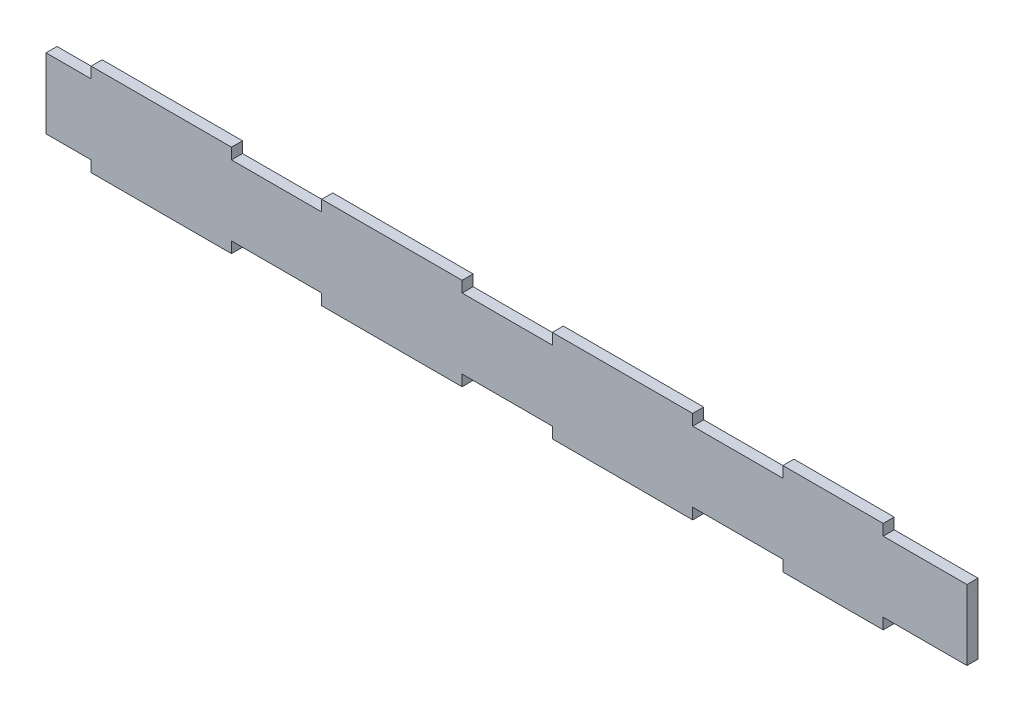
ISO-10303-21;
HEADER;
FILE_DESCRIPTION(('STEP AP214'),'2;1');
FILE_NAME('part.step','',(''),(''),'','','');
FILE_SCHEMA(('AUTOMOTIVE_DESIGN { 1 0 10303 214 1 1 1 1 }'));
ENDSEC;
DATA;
#1=APPLICATION_CONTEXT('core data for automotive mechanical design processes');
#2=APPLICATION_PROTOCOL_DEFINITION('international standard','automotive_design',2000,#1);
#3=PRODUCT_CONTEXT('',#1,'mechanical');
#4=PRODUCT('Part','Part','',(#3));
#5=PRODUCT_RELATED_PRODUCT_CATEGORY('part','',(#4));
#6=PRODUCT_DEFINITION_FORMATION('','',#4);
#7=PRODUCT_DEFINITION_CONTEXT('part definition',#1,'design');
#8=PRODUCT_DEFINITION('design','',#6,#7);
#9=PRODUCT_DEFINITION_SHAPE('','',#8);
#10=(LENGTH_UNIT() NAMED_UNIT(*) SI_UNIT(.MILLI.,.METRE.));
#11=(NAMED_UNIT(*) PLANE_ANGLE_UNIT() SI_UNIT($,.RADIAN.));
#12=(NAMED_UNIT(*) SI_UNIT($,.STERADIAN.) SOLID_ANGLE_UNIT());
#13=UNCERTAINTY_MEASURE_WITH_UNIT(LENGTH_MEASURE(1.E-05),#10,'distance_accuracy_value','');
#14=(GEOMETRIC_REPRESENTATION_CONTEXT(3) GLOBAL_UNCERTAINTY_ASSIGNED_CONTEXT((#13)) GLOBAL_UNIT_ASSIGNED_CONTEXT((#10,
#11,#12)) REPRESENTATION_CONTEXT('',''));
#15=CARTESIAN_POINT('',(0.,0.,0.));
#16=DIRECTION('',(0.,0.,1.));
#17=DIRECTION('',(1.,0.,0.));
#18=AXIS2_PLACEMENT_3D('',#15,#16,#17);
#19=CARTESIAN_POINT('',(228.449972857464,55.4483942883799,5.5));
#20=DIRECTION('',(0.,1.,0.));
#21=DIRECTION('',(0.,0.,1.));
#22=AXIS2_PLACEMENT_3D('',#19,#20,#21);
#23=PLANE('',#22);
#24=DIRECTION('',(1.,0.,0.));
#25=VECTOR('',#24,1.);
#26=CARTESIAN_POINT('',(228.449972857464,55.4483942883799,0.));
#27=LINE('',#26,#25);
#28=CARTESIAN_POINT('',(186.668210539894,55.4483942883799,0.));
#29=VERTEX_POINT('',#28);
#30=CARTESIAN_POINT('',(228.449972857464,55.4483942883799,0.));
#31=VERTEX_POINT('',#30);
#32=EDGE_CURVE('E177',#29,#31,#27,.T.);
#33=ORIENTED_EDGE('',*,*,#32,.T.);
#34=DIRECTION('',(0.,0.,-1.));
#35=VECTOR('',#34,1.);
#36=CARTESIAN_POINT('',(228.449972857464,55.4483942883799,5.5));
#37=LINE('',#36,#35);
#38=CARTESIAN_POINT('',(228.449972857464,55.4483942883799,5.5));
#39=VERTEX_POINT('',#38);
#40=EDGE_CURVE('E11',#39,#31,#37,.T.);
#41=ORIENTED_EDGE('',*,*,#40,.F.);
#42=DIRECTION('',(1.,0.,0.));
#43=VECTOR('',#42,1.);
#44=CARTESIAN_POINT('',(186.668210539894,55.4483942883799,5.5));
#45=LINE('',#44,#43);
#46=CARTESIAN_POINT('',(186.668210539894,55.4483942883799,5.5));
#47=VERTEX_POINT('',#46);
#48=EDGE_CURVE('E183',#47,#39,#45,.T.);
#49=ORIENTED_EDGE('',*,*,#48,.F.);
#50=DIRECTION('',(0.,0.,-1.));
#51=VECTOR('',#50,1.);
#52=CARTESIAN_POINT('',(186.668210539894,55.4483942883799,5.5));
#53=LINE('',#52,#51);
#54=EDGE_CURVE('E301',#47,#29,#53,.T.);
#55=ORIENTED_EDGE('',*,*,#54,.T.);
#56=EDGE_LOOP('',(#33,#41,#49,#55));
#57=FACE_BOUND('',#56,.T.);
#58=ADVANCED_FACE('F41',(#57),#23,.F.);
#59=CARTESIAN_POINT('',(228.449972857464,90.4483942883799,5.5));
#60=DIRECTION('',(-1.,0.,0.));
#61=DIRECTION('',(0.,0.,1.));
#62=AXIS2_PLACEMENT_3D('',#59,#60,#61);
#63=PLANE('',#62);
#64=DIRECTION('',(0.,1.,0.));
#65=VECTOR('',#64,1.);
#66=CARTESIAN_POINT('',(228.449972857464,90.4483942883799,0.));
#67=LINE('',#66,#65);
#68=CARTESIAN_POINT('',(228.449972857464,90.4483942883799,0.));
#69=VERTEX_POINT('',#68);
#70=EDGE_CURVE('E306',#31,#69,#67,.T.);
#71=ORIENTED_EDGE('',*,*,#70,.T.);
#72=DIRECTION('',(0.,0.,-1.));
#73=VECTOR('',#72,1.);
#74=CARTESIAN_POINT('',(228.449972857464,90.4483942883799,5.5));
#75=LINE('',#74,#73);
#76=CARTESIAN_POINT('',(228.449972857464,90.4483942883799,5.5));
#77=VERTEX_POINT('',#76);
#78=EDGE_CURVE('E49',#77,#69,#75,.T.);
#79=ORIENTED_EDGE('',*,*,#78,.F.);
#80=DIRECTION('',(0.,1.,0.));
#81=VECTOR('',#80,1.);
#82=CARTESIAN_POINT('',(228.449972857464,90.4483942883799,5.5));
#83=LINE('',#82,#81);
#84=EDGE_CURVE('E478',#39,#77,#83,.T.);
#85=ORIENTED_EDGE('',*,*,#84,.F.);
#86=ORIENTED_EDGE('',*,*,#40,.T.);
#87=EDGE_LOOP('',(#71,#79,#85,#86));
#88=FACE_BOUND('',#87,.T.);
#89=ADVANCED_FACE('F477',(#88),#63,.F.);
#90=CARTESIAN_POINT('',(186.668210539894,90.4483942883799,5.5));
#91=DIRECTION('',(0.,-1.,0.));
#92=DIRECTION('',(0.,0.,-1.));
#93=AXIS2_PLACEMENT_3D('',#90,#91,#92);
#94=PLANE('',#93);
#95=DIRECTION('',(-1.,0.,0.));
#96=VECTOR('',#95,1.);
#97=CARTESIAN_POINT('',(186.668210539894,90.4483942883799,0.));
#98=LINE('',#97,#96);
#99=CARTESIAN_POINT('',(186.668210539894,90.4483942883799,0.));
#100=VERTEX_POINT('',#99);
#101=EDGE_CURVE('E309',#69,#100,#98,.T.);
#102=ORIENTED_EDGE('',*,*,#101,.T.);
#103=DIRECTION('',(0.,0.,-1.));
#104=VECTOR('',#103,1.);
#105=CARTESIAN_POINT('',(186.668210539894,90.4483942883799,5.5));
#106=LINE('',#105,#104);
#107=CARTESIAN_POINT('',(186.668210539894,90.4483942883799,5.5));
#108=VERTEX_POINT('',#107);
#109=EDGE_CURVE('E466',#108,#100,#106,.T.);
#110=ORIENTED_EDGE('',*,*,#109,.F.);
#111=DIRECTION('',(-1.,0.,0.));
#112=VECTOR('',#111,1.);
#113=CARTESIAN_POINT('',(206.668210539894,90.4483942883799,5.5));
#114=LINE('',#113,#112);
#115=EDGE_CURVE('E474',#77,#108,#114,.T.);
#116=ORIENTED_EDGE('',*,*,#115,.F.);
#117=ORIENTED_EDGE('',*,*,#78,.T.);
#118=EDGE_LOOP('',(#102,#110,#116,#117));
#119=FACE_BOUND('',#118,.T.);
#120=ADVANCED_FACE('F472',(#119),#94,.F.);
#121=CARTESIAN_POINT('',(186.668210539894,95.9483942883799,5.5));
#122=DIRECTION('',(-1.,0.,0.));
#123=DIRECTION('',(0.,0.,1.));
#124=AXIS2_PLACEMENT_3D('',#121,#122,#123);
#125=PLANE('',#124);
#126=DIRECTION('',(0.,1.,0.));
#127=VECTOR('',#126,1.);
#128=CARTESIAN_POINT('',(186.668210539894,95.9483942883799,0.));
#129=LINE('',#128,#127);
#130=CARTESIAN_POINT('',(186.668210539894,95.9483942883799,0.));
#131=VERTEX_POINT('',#130);
#132=EDGE_CURVE('E311',#100,#131,#129,.T.);
#133=ORIENTED_EDGE('',*,*,#132,.T.);
#134=DIRECTION('',(0.,0.,-1.));
#135=VECTOR('',#134,1.);
#136=CARTESIAN_POINT('',(186.668210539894,95.9483942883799,5.5));
#137=LINE('',#136,#135);
#138=CARTESIAN_POINT('',(186.668210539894,95.9483942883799,5.5));
#139=VERTEX_POINT('',#138);
#140=EDGE_CURVE('E463',#139,#131,#137,.T.);
#141=ORIENTED_EDGE('',*,*,#140,.F.);
#142=DIRECTION('',(0.,1.,0.));
#143=VECTOR('',#142,1.);
#144=CARTESIAN_POINT('',(186.668210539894,95.9483942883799,5.5));
#145=LINE('',#144,#143);
#146=EDGE_CURVE('E494',#108,#139,#145,.T.);
#147=ORIENTED_EDGE('',*,*,#146,.F.);
#148=ORIENTED_EDGE('',*,*,#109,.T.);
#149=EDGE_LOOP('',(#133,#141,#147,#148));
#150=FACE_BOUND('',#149,.T.);
#151=ADVANCED_FACE('F485',(#150),#125,.F.);
#152=CARTESIAN_POINT('',(136.668210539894,95.9483942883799,5.5));
#153=DIRECTION('',(0.,-1.,0.));
#154=DIRECTION('',(0.,0.,-1.));
#155=AXIS2_PLACEMENT_3D('',#152,#153,#154);
#156=PLANE('',#155);
#157=DIRECTION('',(-1.,0.,0.));
#158=VECTOR('',#157,1.);
#159=CARTESIAN_POINT('',(136.668210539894,95.9483942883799,0.));
#160=LINE('',#159,#158);
#161=CARTESIAN_POINT('',(136.668210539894,95.9483942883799,0.));
#162=VERTEX_POINT('',#161);
#163=EDGE_CURVE('E313',#131,#162,#160,.T.);
#164=ORIENTED_EDGE('',*,*,#163,.T.);
#165=DIRECTION('',(0.,0.,-1.));
#166=VECTOR('',#165,1.);
#167=CARTESIAN_POINT('',(136.668210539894,95.9483942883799,5.5));
#168=LINE('',#167,#166);
#169=CARTESIAN_POINT('',(136.668210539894,95.9483942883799,5.5));
#170=VERTEX_POINT('',#169);
#171=EDGE_CURVE('E460',#170,#162,#168,.T.);
#172=ORIENTED_EDGE('',*,*,#171,.F.);
#173=DIRECTION('',(-1.,0.,0.));
#174=VECTOR('',#173,1.);
#175=CARTESIAN_POINT('',(136.668210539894,95.9483942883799,5.5));
#176=LINE('',#175,#174);
#177=EDGE_CURVE('E491',#139,#170,#176,.T.);
#178=ORIENTED_EDGE('',*,*,#177,.F.);
#179=ORIENTED_EDGE('',*,*,#140,.T.);
#180=EDGE_LOOP('',(#164,#172,#178,#179));
#181=FACE_BOUND('',#180,.T.);
#182=ADVANCED_FACE('F489',(#181),#156,.F.);
#183=CARTESIAN_POINT('',(136.668210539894,90.4483942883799,5.5));
#184=DIRECTION('',(1.,0.,0.));
#185=DIRECTION('',(0.,0.,-1.));
#186=AXIS2_PLACEMENT_3D('',#183,#184,#185);
#187=PLANE('',#186);
#188=DIRECTION('',(0.,-1.,0.));
#189=VECTOR('',#188,1.);
#190=CARTESIAN_POINT('',(136.668210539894,90.4483942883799,0.));
#191=LINE('',#190,#189);
#192=CARTESIAN_POINT('',(136.668210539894,90.4483942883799,0.));
#193=VERTEX_POINT('',#192);
#194=EDGE_CURVE('E315',#162,#193,#191,.T.);
#195=ORIENTED_EDGE('',*,*,#194,.T.);
#196=DIRECTION('',(0.,0.,-1.));
#197=VECTOR('',#196,1.);
#198=CARTESIAN_POINT('',(136.668210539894,90.4483942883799,5.5));
#199=LINE('',#198,#197);
#200=CARTESIAN_POINT('',(136.668210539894,90.4483942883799,5.5));
#201=VERTEX_POINT('',#200);
#202=EDGE_CURVE('E457',#201,#193,#199,.T.);
#203=ORIENTED_EDGE('',*,*,#202,.F.);
#204=DIRECTION('',(0.,-1.,0.));
#205=VECTOR('',#204,1.);
#206=CARTESIAN_POINT('',(136.668210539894,90.4483942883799,5.5));
#207=LINE('',#206,#205);
#208=EDGE_CURVE('E493',#170,#201,#207,.T.);
#209=ORIENTED_EDGE('',*,*,#208,.F.);
#210=ORIENTED_EDGE('',*,*,#171,.T.);
#211=EDGE_LOOP('',(#195,#203,#209,#210));
#212=FACE_BOUND('',#211,.T.);
#213=ADVANCED_FACE('F579',(#212),#187,.F.);
#214=CARTESIAN_POINT('',(91.6682105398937,90.4483942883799,5.5));
#215=DIRECTION('',(0.,-1.,0.));
#216=DIRECTION('',(0.,0.,-1.));
#217=AXIS2_PLACEMENT_3D('',#214,#215,#216);
#218=PLANE('',#217);
#219=DIRECTION('',(-1.,0.,0.));
#220=VECTOR('',#219,1.);
#221=CARTESIAN_POINT('',(91.6682105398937,90.4483942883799,0.));
#222=LINE('',#221,#220);
#223=CARTESIAN_POINT('',(91.6682105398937,90.4483942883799,0.));
#224=VERTEX_POINT('',#223);
#225=EDGE_CURVE('E317',#193,#224,#222,.T.);
#226=ORIENTED_EDGE('',*,*,#225,.T.);
#227=DIRECTION('',(0.,0.,-1.));
#228=VECTOR('',#227,1.);
#229=CARTESIAN_POINT('',(91.6682105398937,90.4483942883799,5.5));
#230=LINE('',#229,#228);
#231=CARTESIAN_POINT('',(91.6682105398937,90.4483942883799,5.5));
#232=VERTEX_POINT('',#231);
#233=EDGE_CURVE('E454',#232,#224,#230,.T.);
#234=ORIENTED_EDGE('',*,*,#233,.F.);
#235=DIRECTION('',(-1.,0.,0.));
#236=VECTOR('',#235,1.);
#237=CARTESIAN_POINT('',(91.6682105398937,90.4483942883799,5.5));
#238=LINE('',#237,#236);
#239=EDGE_CURVE('E496',#201,#232,#238,.T.);
#240=ORIENTED_EDGE('',*,*,#239,.F.);
#241=ORIENTED_EDGE('',*,*,#202,.T.);
#242=EDGE_LOOP('',(#226,#234,#240,#241));
#243=FACE_BOUND('',#242,.T.);
#244=ADVANCED_FACE('F582',(#243),#218,.F.);
#245=CARTESIAN_POINT('',(91.6682105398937,95.9483942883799,5.5));
#246=DIRECTION('',(-1.,0.,0.));
#247=DIRECTION('',(0.,0.,1.));
#248=AXIS2_PLACEMENT_3D('',#245,#246,#247);
#249=PLANE('',#248);
#250=DIRECTION('',(0.,1.,0.));
#251=VECTOR('',#250,1.);
#252=CARTESIAN_POINT('',(91.6682105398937,95.9483942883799,0.));
#253=LINE('',#252,#251);
#254=CARTESIAN_POINT('',(91.6682105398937,95.9483942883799,0.));
#255=VERTEX_POINT('',#254);
#256=EDGE_CURVE('E319',#224,#255,#253,.T.);
#257=ORIENTED_EDGE('',*,*,#256,.T.);
#258=DIRECTION('',(0.,0.,-1.));
#259=VECTOR('',#258,1.);
#260=CARTESIAN_POINT('',(91.6682105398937,95.9483942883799,5.5));
#261=LINE('',#260,#259);
#262=CARTESIAN_POINT('',(91.6682105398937,95.9483942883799,5.5));
#263=VERTEX_POINT('',#262);
#264=EDGE_CURVE('E451',#263,#255,#261,.T.);
#265=ORIENTED_EDGE('',*,*,#264,.F.);
#266=DIRECTION('',(0.,1.,0.));
#267=VECTOR('',#266,1.);
#268=CARTESIAN_POINT('',(91.6682105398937,95.9483942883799,5.5));
#269=LINE('',#268,#267);
#270=EDGE_CURVE('E502',#232,#263,#269,.T.);
#271=ORIENTED_EDGE('',*,*,#270,.F.);
#272=ORIENTED_EDGE('',*,*,#233,.T.);
#273=EDGE_LOOP('',(#257,#265,#271,#272));
#274=FACE_BOUND('',#273,.T.);
#275=ADVANCED_FACE('F586',(#274),#249,.F.);
#276=CARTESIAN_POINT('',(21.6682105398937,95.9483942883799,5.5));
#277=DIRECTION('',(0.,-1.,0.));
#278=DIRECTION('',(0.,0.,-1.));
#279=AXIS2_PLACEMENT_3D('',#276,#277,#278);
#280=PLANE('',#279);
#281=DIRECTION('',(-1.,0.,0.));
#282=VECTOR('',#281,1.);
#283=CARTESIAN_POINT('',(21.6682105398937,95.9483942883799,0.));
#284=LINE('',#283,#282);
#285=CARTESIAN_POINT('',(21.6682105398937,95.9483942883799,0.));
#286=VERTEX_POINT('',#285);
#287=EDGE_CURVE('E321',#255,#286,#284,.T.);
#288=ORIENTED_EDGE('',*,*,#287,.T.);
#289=DIRECTION('',(0.,0.,-1.));
#290=VECTOR('',#289,1.);
#291=CARTESIAN_POINT('',(21.6682105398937,95.9483942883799,5.5));
#292=LINE('',#291,#290);
#293=CARTESIAN_POINT('',(21.6682105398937,95.9483942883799,5.5));
#294=VERTEX_POINT('',#293);
#295=EDGE_CURVE('E448',#294,#286,#292,.T.);
#296=ORIENTED_EDGE('',*,*,#295,.F.);
#297=DIRECTION('',(-1.,0.,0.));
#298=VECTOR('',#297,1.);
#299=CARTESIAN_POINT('',(21.6682105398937,95.9483942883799,5.5));
#300=LINE('',#299,#298);
#301=EDGE_CURVE('E504',#263,#294,#300,.T.);
#302=ORIENTED_EDGE('',*,*,#301,.F.);
#303=ORIENTED_EDGE('',*,*,#264,.T.);
#304=EDGE_LOOP('',(#288,#296,#302,#303));
#305=FACE_BOUND('',#304,.T.);
#306=ADVANCED_FACE('F590',(#305),#280,.F.);
#307=CARTESIAN_POINT('',(21.6682105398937,90.4483942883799,5.5));
#308=DIRECTION('',(1.,0.,0.));
#309=DIRECTION('',(0.,0.,-1.));
#310=AXIS2_PLACEMENT_3D('',#307,#308,#309);
#311=PLANE('',#310);
#312=DIRECTION('',(0.,-1.,0.));
#313=VECTOR('',#312,1.);
#314=CARTESIAN_POINT('',(21.6682105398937,90.4483942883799,0.));
#315=LINE('',#314,#313);
#316=CARTESIAN_POINT('',(21.6682105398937,90.4483942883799,0.));
#317=VERTEX_POINT('',#316);
#318=EDGE_CURVE('E323',#286,#317,#315,.T.);
#319=ORIENTED_EDGE('',*,*,#318,.T.);
#320=DIRECTION('',(0.,0.,-1.));
#321=VECTOR('',#320,1.);
#322=CARTESIAN_POINT('',(21.6682105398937,90.4483942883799,5.5));
#323=LINE('',#322,#321);
#324=CARTESIAN_POINT('',(21.6682105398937,90.4483942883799,5.5));
#325=VERTEX_POINT('',#324);
#326=EDGE_CURVE('E445',#325,#317,#323,.T.);
#327=ORIENTED_EDGE('',*,*,#326,.F.);
#328=DIRECTION('',(0.,-1.,0.));
#329=VECTOR('',#328,1.);
#330=CARTESIAN_POINT('',(21.6682105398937,90.4483942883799,5.5));
#331=LINE('',#330,#329);
#332=EDGE_CURVE('E506',#294,#325,#331,.T.);
#333=ORIENTED_EDGE('',*,*,#332,.F.);
#334=ORIENTED_EDGE('',*,*,#295,.T.);
#335=EDGE_LOOP('',(#319,#327,#333,#334));
#336=FACE_BOUND('',#335,.T.);
#337=ADVANCED_FACE('F594',(#336),#311,.F.);
#338=CARTESIAN_POINT('',(-23.3317894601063,90.4483942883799,5.5));
#339=DIRECTION('',(0.,-1.,0.));
#340=DIRECTION('',(0.,0.,-1.));
#341=AXIS2_PLACEMENT_3D('',#338,#339,#340);
#342=PLANE('',#341);
#343=DIRECTION('',(-1.,0.,0.));
#344=VECTOR('',#343,1.);
#345=CARTESIAN_POINT('',(-23.3317894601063,90.4483942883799,0.));
#346=LINE('',#345,#344);
#347=CARTESIAN_POINT('',(-23.3317894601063,90.4483942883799,0.));
#348=VERTEX_POINT('',#347);
#349=EDGE_CURVE('E325',#317,#348,#346,.T.);
#350=ORIENTED_EDGE('',*,*,#349,.T.);
#351=DIRECTION('',(0.,0.,-1.));
#352=VECTOR('',#351,1.);
#353=CARTESIAN_POINT('',(-23.3317894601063,90.4483942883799,5.5));
#354=LINE('',#353,#352);
#355=CARTESIAN_POINT('',(-23.3317894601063,90.4483942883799,5.5));
#356=VERTEX_POINT('',#355);
#357=EDGE_CURVE('E442',#356,#348,#354,.T.);
#358=ORIENTED_EDGE('',*,*,#357,.F.);
#359=DIRECTION('',(-1.,0.,0.));
#360=VECTOR('',#359,1.);
#361=CARTESIAN_POINT('',(-23.3317894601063,90.4483942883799,5.5));
#362=LINE('',#361,#360);
#363=EDGE_CURVE('E508',#325,#356,#362,.T.);
#364=ORIENTED_EDGE('',*,*,#363,.F.);
#365=ORIENTED_EDGE('',*,*,#326,.T.);
#366=EDGE_LOOP('',(#350,#358,#364,#365));
#367=FACE_BOUND('',#366,.T.);
#368=ADVANCED_FACE('F598',(#367),#342,.F.);
#369=CARTESIAN_POINT('',(-23.3317894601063,95.9483942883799,5.5));
#370=DIRECTION('',(-1.,0.,0.));
#371=DIRECTION('',(0.,0.,1.));
#372=AXIS2_PLACEMENT_3D('',#369,#370,#371);
#373=PLANE('',#372);
#374=DIRECTION('',(0.,1.,0.));
#375=VECTOR('',#374,1.);
#376=CARTESIAN_POINT('',(-23.3317894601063,95.9483942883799,0.));
#377=LINE('',#376,#375);
#378=CARTESIAN_POINT('',(-23.3317894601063,95.9483942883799,0.));
#379=VERTEX_POINT('',#378);
#380=EDGE_CURVE('E327',#348,#379,#377,.T.);
#381=ORIENTED_EDGE('',*,*,#380,.T.);
#382=DIRECTION('',(0.,0.,-1.));
#383=VECTOR('',#382,1.);
#384=CARTESIAN_POINT('',(-23.3317894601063,95.9483942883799,5.5));
#385=LINE('',#384,#383);
#386=CARTESIAN_POINT('',(-23.3317894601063,95.9483942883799,5.5));
#387=VERTEX_POINT('',#386);
#388=EDGE_CURVE('E439',#387,#379,#385,.T.);
#389=ORIENTED_EDGE('',*,*,#388,.F.);
#390=DIRECTION('',(0.,1.,0.));
#391=VECTOR('',#390,1.);
#392=CARTESIAN_POINT('',(-23.3317894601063,95.9483942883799,5.5));
#393=LINE('',#392,#391);
#394=EDGE_CURVE('E510',#356,#387,#393,.T.);
#395=ORIENTED_EDGE('',*,*,#394,.F.);
#396=ORIENTED_EDGE('',*,*,#357,.T.);
#397=EDGE_LOOP('',(#381,#389,#395,#396));
#398=FACE_BOUND('',#397,.T.);
#399=ADVANCED_FACE('F602',(#398),#373,.F.);
#400=CARTESIAN_POINT('',(-93.3317894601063,95.9483942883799,5.5));
#401=DIRECTION('',(0.,-1.,0.));
#402=DIRECTION('',(0.,0.,-1.));
#403=AXIS2_PLACEMENT_3D('',#400,#401,#402);
#404=PLANE('',#403);
#405=DIRECTION('',(-1.,0.,0.));
#406=VECTOR('',#405,1.);
#407=CARTESIAN_POINT('',(-93.3317894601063,95.9483942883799,0.));
#408=LINE('',#407,#406);
#409=CARTESIAN_POINT('',(-93.3317894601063,95.9483942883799,0.));
#410=VERTEX_POINT('',#409);
#411=EDGE_CURVE('E329',#379,#410,#408,.T.);
#412=ORIENTED_EDGE('',*,*,#411,.T.);
#413=DIRECTION('',(0.,0.,-1.));
#414=VECTOR('',#413,1.);
#415=CARTESIAN_POINT('',(-93.3317894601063,95.9483942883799,5.5));
#416=LINE('',#415,#414);
#417=CARTESIAN_POINT('',(-93.3317894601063,95.9483942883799,5.5));
#418=VERTEX_POINT('',#417);
#419=EDGE_CURVE('E436',#418,#410,#416,.T.);
#420=ORIENTED_EDGE('',*,*,#419,.F.);
#421=DIRECTION('',(-1.,0.,0.));
#422=VECTOR('',#421,1.);
#423=CARTESIAN_POINT('',(-93.3317894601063,95.9483942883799,5.5));
#424=LINE('',#423,#422);
#425=EDGE_CURVE('E512',#387,#418,#424,.T.);
#426=ORIENTED_EDGE('',*,*,#425,.F.);
#427=ORIENTED_EDGE('',*,*,#388,.T.);
#428=EDGE_LOOP('',(#412,#420,#426,#427));
#429=FACE_BOUND('',#428,.T.);
#430=ADVANCED_FACE('F606',(#429),#404,.F.);
#431=CARTESIAN_POINT('',(-93.3317894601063,90.4483942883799,5.5));
#432=DIRECTION('',(1.,0.,0.));
#433=DIRECTION('',(0.,0.,-1.));
#434=AXIS2_PLACEMENT_3D('',#431,#432,#433);
#435=PLANE('',#434);
#436=DIRECTION('',(0.,-1.,0.));
#437=VECTOR('',#436,1.);
#438=CARTESIAN_POINT('',(-93.3317894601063,90.4483942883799,0.));
#439=LINE('',#438,#437);
#440=CARTESIAN_POINT('',(-93.3317894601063,90.4483942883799,0.));
#441=VERTEX_POINT('',#440);
#442=EDGE_CURVE('E331',#410,#441,#439,.T.);
#443=ORIENTED_EDGE('',*,*,#442,.T.);
#444=DIRECTION('',(0.,0.,-1.));
#445=VECTOR('',#444,1.);
#446=CARTESIAN_POINT('',(-93.3317894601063,90.4483942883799,5.5));
#447=LINE('',#446,#445);
#448=CARTESIAN_POINT('',(-93.3317894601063,90.4483942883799,5.5));
#449=VERTEX_POINT('',#448);
#450=EDGE_CURVE('E433',#449,#441,#447,.T.);
#451=ORIENTED_EDGE('',*,*,#450,.F.);
#452=DIRECTION('',(0.,-1.,0.));
#453=VECTOR('',#452,1.);
#454=CARTESIAN_POINT('',(-93.3317894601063,90.4483942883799,5.5));
#455=LINE('',#454,#453);
#456=EDGE_CURVE('E514',#418,#449,#455,.T.);
#457=ORIENTED_EDGE('',*,*,#456,.F.);
#458=ORIENTED_EDGE('',*,*,#419,.T.);
#459=EDGE_LOOP('',(#443,#451,#457,#458));
#460=FACE_BOUND('',#459,.T.);
#461=ADVANCED_FACE('F610',(#460),#435,.F.);
#462=CARTESIAN_POINT('',(-138.331789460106,90.4483942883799,5.5));
#463=DIRECTION('',(0.,-1.,0.));
#464=DIRECTION('',(0.,0.,-1.));
#465=AXIS2_PLACEMENT_3D('',#462,#463,#464);
#466=PLANE('',#465);
#467=DIRECTION('',(-1.,0.,0.));
#468=VECTOR('',#467,1.);
#469=CARTESIAN_POINT('',(-138.331789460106,90.4483942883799,0.));
#470=LINE('',#469,#468);
#471=CARTESIAN_POINT('',(-138.331789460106,90.4483942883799,0.));
#472=VERTEX_POINT('',#471);
#473=EDGE_CURVE('E333',#441,#472,#470,.T.);
#474=ORIENTED_EDGE('',*,*,#473,.T.);
#475=DIRECTION('',(0.,0.,-1.));
#476=VECTOR('',#475,1.);
#477=CARTESIAN_POINT('',(-138.331789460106,90.4483942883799,5.5));
#478=LINE('',#477,#476);
#479=CARTESIAN_POINT('',(-138.331789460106,90.4483942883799,5.5));
#480=VERTEX_POINT('',#479);
#481=EDGE_CURVE('E430',#480,#472,#478,.T.);
#482=ORIENTED_EDGE('',*,*,#481,.F.);
#483=DIRECTION('',(-1.,0.,0.));
#484=VECTOR('',#483,1.);
#485=CARTESIAN_POINT('',(-138.331789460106,90.4483942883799,5.5));
#486=LINE('',#485,#484);
#487=EDGE_CURVE('E516',#449,#480,#486,.T.);
#488=ORIENTED_EDGE('',*,*,#487,.F.);
#489=ORIENTED_EDGE('',*,*,#450,.T.);
#490=EDGE_LOOP('',(#474,#482,#488,#489));
#491=FACE_BOUND('',#490,.T.);
#492=ADVANCED_FACE('F614',(#491),#466,.F.);
#493=CARTESIAN_POINT('',(-138.331789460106,95.9483942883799,5.5));
#494=DIRECTION('',(-1.,0.,0.));
#495=DIRECTION('',(0.,0.,1.));
#496=AXIS2_PLACEMENT_3D('',#493,#494,#495);
#497=PLANE('',#496);
#498=DIRECTION('',(0.,1.,0.));
#499=VECTOR('',#498,1.);
#500=CARTESIAN_POINT('',(-138.331789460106,95.9483942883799,0.));
#501=LINE('',#500,#499);
#502=CARTESIAN_POINT('',(-138.331789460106,95.9483942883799,0.));
#503=VERTEX_POINT('',#502);
#504=EDGE_CURVE('E335',#472,#503,#501,.T.);
#505=ORIENTED_EDGE('',*,*,#504,.T.);
#506=DIRECTION('',(0.,0.,-1.));
#507=VECTOR('',#506,1.);
#508=CARTESIAN_POINT('',(-138.331789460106,95.9483942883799,5.5));
#509=LINE('',#508,#507);
#510=CARTESIAN_POINT('',(-138.331789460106,95.9483942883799,5.5));
#511=VERTEX_POINT('',#510);
#512=EDGE_CURVE('E427',#511,#503,#509,.T.);
#513=ORIENTED_EDGE('',*,*,#512,.F.);
#514=DIRECTION('',(0.,1.,0.));
#515=VECTOR('',#514,1.);
#516=CARTESIAN_POINT('',(-138.331789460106,95.9483942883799,5.5));
#517=LINE('',#516,#515);
#518=EDGE_CURVE('E518',#480,#511,#517,.T.);
#519=ORIENTED_EDGE('',*,*,#518,.F.);
#520=ORIENTED_EDGE('',*,*,#481,.T.);
#521=EDGE_LOOP('',(#505,#513,#519,#520));
#522=FACE_BOUND('',#521,.T.);
#523=ADVANCED_FACE('F618',(#522),#497,.F.);
#524=CARTESIAN_POINT('',(-208.331789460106,95.9483942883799,5.5));
#525=DIRECTION('',(0.,-1.,0.));
#526=DIRECTION('',(0.,0.,-1.));
#527=AXIS2_PLACEMENT_3D('',#524,#525,#526);
#528=PLANE('',#527);
#529=DIRECTION('',(-1.,0.,0.));
#530=VECTOR('',#529,1.);
#531=CARTESIAN_POINT('',(-208.331789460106,95.9483942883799,0.));
#532=LINE('',#531,#530);
#533=CARTESIAN_POINT('',(-208.331789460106,95.9483942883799,0.));
#534=VERTEX_POINT('',#533);
#535=EDGE_CURVE('E337',#503,#534,#532,.T.);
#536=ORIENTED_EDGE('',*,*,#535,.T.);
#537=DIRECTION('',(0.,0.,-1.));
#538=VECTOR('',#537,1.);
#539=CARTESIAN_POINT('',(-208.331789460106,95.9483942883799,5.5));
#540=LINE('',#539,#538);
#541=CARTESIAN_POINT('',(-208.331789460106,95.9483942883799,5.5));
#542=VERTEX_POINT('',#541);
#543=EDGE_CURVE('E424',#542,#534,#540,.T.);
#544=ORIENTED_EDGE('',*,*,#543,.F.);
#545=DIRECTION('',(-1.,0.,0.));
#546=VECTOR('',#545,1.);
#547=CARTESIAN_POINT('',(-208.331789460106,95.9483942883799,5.5));
#548=LINE('',#547,#546);
#549=EDGE_CURVE('E520',#511,#542,#548,.T.);
#550=ORIENTED_EDGE('',*,*,#549,.F.);
#551=ORIENTED_EDGE('',*,*,#512,.T.);
#552=EDGE_LOOP('',(#536,#544,#550,#551));
#553=FACE_BOUND('',#552,.T.);
#554=ADVANCED_FACE('F622',(#553),#528,.F.);
#555=CARTESIAN_POINT('',(-208.331789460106,90.4483942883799,5.5));
#556=DIRECTION('',(1.,0.,0.));
#557=DIRECTION('',(0.,0.,-1.));
#558=AXIS2_PLACEMENT_3D('',#555,#556,#557);
#559=PLANE('',#558);
#560=DIRECTION('',(0.,-1.,0.));
#561=VECTOR('',#560,1.);
#562=CARTESIAN_POINT('',(-208.331789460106,90.4483942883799,0.));
#563=LINE('',#562,#561);
#564=CARTESIAN_POINT('',(-208.331789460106,90.4483942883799,0.));
#565=VERTEX_POINT('',#564);
#566=EDGE_CURVE('E339',#534,#565,#563,.T.);
#567=ORIENTED_EDGE('',*,*,#566,.T.);
#568=DIRECTION('',(0.,0.,-1.));
#569=VECTOR('',#568,1.);
#570=CARTESIAN_POINT('',(-208.331789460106,90.4483942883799,5.5));
#571=LINE('',#570,#569);
#572=CARTESIAN_POINT('',(-208.331789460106,90.4483942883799,5.5));
#573=VERTEX_POINT('',#572);
#574=EDGE_CURVE('E421',#573,#565,#571,.T.);
#575=ORIENTED_EDGE('',*,*,#574,.F.);
#576=DIRECTION('',(0.,-1.,0.));
#577=VECTOR('',#576,1.);
#578=CARTESIAN_POINT('',(-208.331789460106,90.4483942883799,5.5));
#579=LINE('',#578,#577);
#580=EDGE_CURVE('E522',#542,#573,#579,.T.);
#581=ORIENTED_EDGE('',*,*,#580,.F.);
#582=ORIENTED_EDGE('',*,*,#543,.T.);
#583=EDGE_LOOP('',(#567,#575,#581,#582));
#584=FACE_BOUND('',#583,.T.);
#585=ADVANCED_FACE('F626',(#584),#559,.F.);
#586=CARTESIAN_POINT('',(-230.831789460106,90.4483942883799,5.5));
#587=DIRECTION('',(0.,-1.,0.));
#588=DIRECTION('',(0.,0.,-1.));
#589=AXIS2_PLACEMENT_3D('',#586,#587,#588);
#590=PLANE('',#589);
#591=DIRECTION('',(-1.,0.,0.));
#592=VECTOR('',#591,1.);
#593=CARTESIAN_POINT('',(-230.831789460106,90.4483942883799,0.));
#594=LINE('',#593,#592);
#595=CARTESIAN_POINT('',(-230.831789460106,90.4483942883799,0.));
#596=VERTEX_POINT('',#595);
#597=EDGE_CURVE('E341',#565,#596,#594,.T.);
#598=ORIENTED_EDGE('',*,*,#597,.T.);
#599=DIRECTION('',(0.,0.,-1.));
#600=VECTOR('',#599,1.);
#601=CARTESIAN_POINT('',(-230.831789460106,90.4483942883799,5.5));
#602=LINE('',#601,#600);
#603=CARTESIAN_POINT('',(-230.831789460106,90.4483942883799,5.5));
#604=VERTEX_POINT('',#603);
#605=EDGE_CURVE('E418',#604,#596,#602,.T.);
#606=ORIENTED_EDGE('',*,*,#605,.F.);
#607=DIRECTION('',(-1.,0.,0.));
#608=VECTOR('',#607,1.);
#609=CARTESIAN_POINT('',(-230.831789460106,90.4483942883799,5.5));
#610=LINE('',#609,#608);
#611=EDGE_CURVE('E524',#573,#604,#610,.T.);
#612=ORIENTED_EDGE('',*,*,#611,.F.);
#613=ORIENTED_EDGE('',*,*,#574,.T.);
#614=EDGE_LOOP('',(#598,#606,#612,#613));
#615=FACE_BOUND('',#614,.T.);
#616=ADVANCED_FACE('F630',(#615),#590,.F.);
#617=CARTESIAN_POINT('',(-230.831789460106,55.4483942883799,5.5));
#618=DIRECTION('',(1.,0.,0.));
#619=DIRECTION('',(0.,0.,-1.));
#620=AXIS2_PLACEMENT_3D('',#617,#618,#619);
#621=PLANE('',#620);
#622=DIRECTION('',(0.,-1.,0.));
#623=VECTOR('',#622,1.);
#624=CARTESIAN_POINT('',(-230.831789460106,55.4483942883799,0.));
#625=LINE('',#624,#623);
#626=CARTESIAN_POINT('',(-230.831789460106,55.4483942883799,0.));
#627=VERTEX_POINT('',#626);
#628=EDGE_CURVE('E343',#596,#627,#625,.T.);
#629=ORIENTED_EDGE('',*,*,#628,.T.);
#630=DIRECTION('',(0.,0.,-1.));
#631=VECTOR('',#630,1.);
#632=CARTESIAN_POINT('',(-230.831789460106,55.4483942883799,5.5));
#633=LINE('',#632,#631);
#634=CARTESIAN_POINT('',(-230.831789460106,55.4483942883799,5.5));
#635=VERTEX_POINT('',#634);
#636=EDGE_CURVE('E415',#635,#627,#633,.T.);
#637=ORIENTED_EDGE('',*,*,#636,.F.);
#638=DIRECTION('',(0.,-1.,0.));
#639=VECTOR('',#638,1.);
#640=CARTESIAN_POINT('',(-230.831789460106,55.4483942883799,5.5));
#641=LINE('',#640,#639);
#642=EDGE_CURVE('E526',#604,#635,#641,.T.);
#643=ORIENTED_EDGE('',*,*,#642,.F.);
#644=ORIENTED_EDGE('',*,*,#605,.T.);
#645=EDGE_LOOP('',(#629,#637,#643,#644));
#646=FACE_BOUND('',#645,.T.);
#647=ADVANCED_FACE('F634',(#646),#621,.F.);
#648=CARTESIAN_POINT('',(-208.331789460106,55.4483942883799,5.5));
#649=DIRECTION('',(0.,1.,0.));
#650=DIRECTION('',(0.,0.,1.));
#651=AXIS2_PLACEMENT_3D('',#648,#649,#650);
#652=PLANE('',#651);
#653=DIRECTION('',(1.,0.,0.));
#654=VECTOR('',#653,1.);
#655=CARTESIAN_POINT('',(-208.331789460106,55.4483942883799,0.));
#656=LINE('',#655,#654);
#657=CARTESIAN_POINT('',(-208.331789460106,55.4483942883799,0.));
#658=VERTEX_POINT('',#657);
#659=EDGE_CURVE('E345',#627,#658,#656,.T.);
#660=ORIENTED_EDGE('',*,*,#659,.T.);
#661=DIRECTION('',(0.,0.,-1.));
#662=VECTOR('',#661,1.);
#663=CARTESIAN_POINT('',(-208.331789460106,55.4483942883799,5.5));
#664=LINE('',#663,#662);
#665=CARTESIAN_POINT('',(-208.331789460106,55.4483942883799,5.5));
#666=VERTEX_POINT('',#665);
#667=EDGE_CURVE('E412',#666,#658,#664,.T.);
#668=ORIENTED_EDGE('',*,*,#667,.F.);
#669=DIRECTION('',(1.,0.,0.));
#670=VECTOR('',#669,1.);
#671=CARTESIAN_POINT('',(-208.331789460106,55.4483942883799,5.5));
#672=LINE('',#671,#670);
#673=EDGE_CURVE('E528',#635,#666,#672,.T.);
#674=ORIENTED_EDGE('',*,*,#673,.F.);
#675=ORIENTED_EDGE('',*,*,#636,.T.);
#676=EDGE_LOOP('',(#660,#668,#674,#675));
#677=FACE_BOUND('',#676,.T.);
#678=ADVANCED_FACE('F638',(#677),#652,.F.);
#679=CARTESIAN_POINT('',(-208.331789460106,49.9483942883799,5.5));
#680=DIRECTION('',(1.,0.,0.));
#681=DIRECTION('',(0.,0.,-1.));
#682=AXIS2_PLACEMENT_3D('',#679,#680,#681);
#683=PLANE('',#682);
#684=DIRECTION('',(0.,-1.,0.));
#685=VECTOR('',#684,1.);
#686=CARTESIAN_POINT('',(-208.331789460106,49.9483942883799,0.));
#687=LINE('',#686,#685);
#688=CARTESIAN_POINT('',(-208.331789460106,49.9483942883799,0.));
#689=VERTEX_POINT('',#688);
#690=EDGE_CURVE('E347',#658,#689,#687,.T.);
#691=ORIENTED_EDGE('',*,*,#690,.T.);
#692=DIRECTION('',(0.,0.,-1.));
#693=VECTOR('',#692,1.);
#694=CARTESIAN_POINT('',(-208.331789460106,49.9483942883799,5.5));
#695=LINE('',#694,#693);
#696=CARTESIAN_POINT('',(-208.331789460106,49.9483942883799,5.5));
#697=VERTEX_POINT('',#696);
#698=EDGE_CURVE('E409',#697,#689,#695,.T.);
#699=ORIENTED_EDGE('',*,*,#698,.F.);
#700=DIRECTION('',(0.,-1.,0.));
#701=VECTOR('',#700,1.);
#702=CARTESIAN_POINT('',(-208.331789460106,49.9483942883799,5.5));
#703=LINE('',#702,#701);
#704=EDGE_CURVE('E530',#666,#697,#703,.T.);
#705=ORIENTED_EDGE('',*,*,#704,.F.);
#706=ORIENTED_EDGE('',*,*,#667,.T.);
#707=EDGE_LOOP('',(#691,#699,#705,#706));
#708=FACE_BOUND('',#707,.T.);
#709=ADVANCED_FACE('F642',(#708),#683,.F.);
#710=CARTESIAN_POINT('',(-138.331789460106,49.9483942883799,5.5));
#711=DIRECTION('',(0.,1.,0.));
#712=DIRECTION('',(0.,0.,1.));
#713=AXIS2_PLACEMENT_3D('',#710,#711,#712);
#714=PLANE('',#713);
#715=DIRECTION('',(1.,0.,0.));
#716=VECTOR('',#715,1.);
#717=CARTESIAN_POINT('',(-138.331789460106,49.9483942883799,0.));
#718=LINE('',#717,#716);
#719=CARTESIAN_POINT('',(-138.331789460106,49.9483942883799,0.));
#720=VERTEX_POINT('',#719);
#721=EDGE_CURVE('E349',#689,#720,#718,.T.);
#722=ORIENTED_EDGE('',*,*,#721,.T.);
#723=DIRECTION('',(0.,0.,-1.));
#724=VECTOR('',#723,1.);
#725=CARTESIAN_POINT('',(-138.331789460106,49.9483942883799,5.5));
#726=LINE('',#725,#724);
#727=CARTESIAN_POINT('',(-138.331789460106,49.9483942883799,5.5));
#728=VERTEX_POINT('',#727);
#729=EDGE_CURVE('E406',#728,#720,#726,.T.);
#730=ORIENTED_EDGE('',*,*,#729,.F.);
#731=DIRECTION('',(1.,0.,0.));
#732=VECTOR('',#731,1.);
#733=CARTESIAN_POINT('',(-138.331789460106,49.9483942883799,5.5));
#734=LINE('',#733,#732);
#735=EDGE_CURVE('E532',#697,#728,#734,.T.);
#736=ORIENTED_EDGE('',*,*,#735,.F.);
#737=ORIENTED_EDGE('',*,*,#698,.T.);
#738=EDGE_LOOP('',(#722,#730,#736,#737));
#739=FACE_BOUND('',#738,.T.);
#740=ADVANCED_FACE('F646',(#739),#714,.F.);
#741=CARTESIAN_POINT('',(-138.331789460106,55.4483942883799,5.5));
#742=DIRECTION('',(-1.,0.,0.));
#743=DIRECTION('',(0.,0.,1.));
#744=AXIS2_PLACEMENT_3D('',#741,#742,#743);
#745=PLANE('',#744);
#746=DIRECTION('',(0.,1.,0.));
#747=VECTOR('',#746,1.);
#748=CARTESIAN_POINT('',(-138.331789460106,55.4483942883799,0.));
#749=LINE('',#748,#747);
#750=CARTESIAN_POINT('',(-138.331789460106,55.4483942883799,0.));
#751=VERTEX_POINT('',#750);
#752=EDGE_CURVE('E351',#720,#751,#749,.T.);
#753=ORIENTED_EDGE('',*,*,#752,.T.);
#754=DIRECTION('',(0.,0.,-1.));
#755=VECTOR('',#754,1.);
#756=CARTESIAN_POINT('',(-138.331789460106,55.4483942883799,5.5));
#757=LINE('',#756,#755);
#758=CARTESIAN_POINT('',(-138.331789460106,55.4483942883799,5.5));
#759=VERTEX_POINT('',#758);
#760=EDGE_CURVE('E403',#759,#751,#757,.T.);
#761=ORIENTED_EDGE('',*,*,#760,.F.);
#762=DIRECTION('',(0.,1.,0.));
#763=VECTOR('',#762,1.);
#764=CARTESIAN_POINT('',(-138.331789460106,55.4483942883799,5.5));
#765=LINE('',#764,#763);
#766=EDGE_CURVE('E534',#728,#759,#765,.T.);
#767=ORIENTED_EDGE('',*,*,#766,.F.);
#768=ORIENTED_EDGE('',*,*,#729,.T.);
#769=EDGE_LOOP('',(#753,#761,#767,#768));
#770=FACE_BOUND('',#769,.T.);
#771=ADVANCED_FACE('F650',(#770),#745,.F.);
#772=CARTESIAN_POINT('',(-93.3317894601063,55.4483942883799,5.5));
#773=DIRECTION('',(0.,1.,0.));
#774=DIRECTION('',(0.,0.,1.));
#775=AXIS2_PLACEMENT_3D('',#772,#773,#774);
#776=PLANE('',#775);
#777=DIRECTION('',(1.,0.,0.));
#778=VECTOR('',#777,1.);
#779=CARTESIAN_POINT('',(-93.3317894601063,55.4483942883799,0.));
#780=LINE('',#779,#778);
#781=CARTESIAN_POINT('',(-93.3317894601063,55.4483942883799,0.));
#782=VERTEX_POINT('',#781);
#783=EDGE_CURVE('E353',#751,#782,#780,.T.);
#784=ORIENTED_EDGE('',*,*,#783,.T.);
#785=DIRECTION('',(0.,0.,-1.));
#786=VECTOR('',#785,1.);
#787=CARTESIAN_POINT('',(-93.3317894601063,55.4483942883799,5.5));
#788=LINE('',#787,#786);
#789=CARTESIAN_POINT('',(-93.3317894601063,55.4483942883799,5.5));
#790=VERTEX_POINT('',#789);
#791=EDGE_CURVE('E400',#790,#782,#788,.T.);
#792=ORIENTED_EDGE('',*,*,#791,.F.);
#793=DIRECTION('',(1.,0.,0.));
#794=VECTOR('',#793,1.);
#795=CARTESIAN_POINT('',(-93.3317894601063,55.4483942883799,5.5));
#796=LINE('',#795,#794);
#797=EDGE_CURVE('E536',#759,#790,#796,.T.);
#798=ORIENTED_EDGE('',*,*,#797,.F.);
#799=ORIENTED_EDGE('',*,*,#760,.T.);
#800=EDGE_LOOP('',(#784,#792,#798,#799));
#801=FACE_BOUND('',#800,.T.);
#802=ADVANCED_FACE('F654',(#801),#776,.F.);
#803=CARTESIAN_POINT('',(-93.3317894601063,49.9483942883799,5.5));
#804=DIRECTION('',(1.,0.,0.));
#805=DIRECTION('',(0.,0.,-1.));
#806=AXIS2_PLACEMENT_3D('',#803,#804,#805);
#807=PLANE('',#806);
#808=DIRECTION('',(0.,-1.,0.));
#809=VECTOR('',#808,1.);
#810=CARTESIAN_POINT('',(-93.3317894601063,49.9483942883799,0.));
#811=LINE('',#810,#809);
#812=CARTESIAN_POINT('',(-93.3317894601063,49.9483942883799,0.));
#813=VERTEX_POINT('',#812);
#814=EDGE_CURVE('E355',#782,#813,#811,.T.);
#815=ORIENTED_EDGE('',*,*,#814,.T.);
#816=DIRECTION('',(0.,0.,-1.));
#817=VECTOR('',#816,1.);
#818=CARTESIAN_POINT('',(-93.3317894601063,49.9483942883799,5.5));
#819=LINE('',#818,#817);
#820=CARTESIAN_POINT('',(-93.3317894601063,49.9483942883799,5.5));
#821=VERTEX_POINT('',#820);
#822=EDGE_CURVE('E397',#821,#813,#819,.T.);
#823=ORIENTED_EDGE('',*,*,#822,.F.);
#824=DIRECTION('',(0.,-1.,0.));
#825=VECTOR('',#824,1.);
#826=CARTESIAN_POINT('',(-93.3317894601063,49.9483942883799,5.5));
#827=LINE('',#826,#825);
#828=EDGE_CURVE('E538',#790,#821,#827,.T.);
#829=ORIENTED_EDGE('',*,*,#828,.F.);
#830=ORIENTED_EDGE('',*,*,#791,.T.);
#831=EDGE_LOOP('',(#815,#823,#829,#830));
#832=FACE_BOUND('',#831,.T.);
#833=ADVANCED_FACE('F658',(#832),#807,.F.);
#834=CARTESIAN_POINT('',(-23.3317894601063,49.9483942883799,5.5));
#835=DIRECTION('',(0.,1.,0.));
#836=DIRECTION('',(0.,0.,1.));
#837=AXIS2_PLACEMENT_3D('',#834,#835,#836);
#838=PLANE('',#837);
#839=DIRECTION('',(1.,0.,0.));
#840=VECTOR('',#839,1.);
#841=CARTESIAN_POINT('',(-23.3317894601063,49.9483942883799,0.));
#842=LINE('',#841,#840);
#843=CARTESIAN_POINT('',(-23.3317894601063,49.9483942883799,0.));
#844=VERTEX_POINT('',#843);
#845=EDGE_CURVE('E357',#813,#844,#842,.T.);
#846=ORIENTED_EDGE('',*,*,#845,.T.);
#847=DIRECTION('',(0.,0.,-1.));
#848=VECTOR('',#847,1.);
#849=CARTESIAN_POINT('',(-23.3317894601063,49.9483942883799,5.5));
#850=LINE('',#849,#848);
#851=CARTESIAN_POINT('',(-23.3317894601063,49.9483942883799,5.5));
#852=VERTEX_POINT('',#851);
#853=EDGE_CURVE('E394',#852,#844,#850,.T.);
#854=ORIENTED_EDGE('',*,*,#853,.F.);
#855=DIRECTION('',(1.,0.,0.));
#856=VECTOR('',#855,1.);
#857=CARTESIAN_POINT('',(-23.3317894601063,49.9483942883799,5.5));
#858=LINE('',#857,#856);
#859=EDGE_CURVE('E540',#821,#852,#858,.T.);
#860=ORIENTED_EDGE('',*,*,#859,.F.);
#861=ORIENTED_EDGE('',*,*,#822,.T.);
#862=EDGE_LOOP('',(#846,#854,#860,#861));
#863=FACE_BOUND('',#862,.T.);
#864=ADVANCED_FACE('F662',(#863),#838,.F.);
#865=CARTESIAN_POINT('',(-23.3317894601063,55.4483942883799,5.5));
#866=DIRECTION('',(-1.,0.,0.));
#867=DIRECTION('',(0.,0.,1.));
#868=AXIS2_PLACEMENT_3D('',#865,#866,#867);
#869=PLANE('',#868);
#870=DIRECTION('',(0.,1.,0.));
#871=VECTOR('',#870,1.);
#872=CARTESIAN_POINT('',(-23.3317894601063,55.4483942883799,0.));
#873=LINE('',#872,#871);
#874=CARTESIAN_POINT('',(-23.3317894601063,55.4483942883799,0.));
#875=VERTEX_POINT('',#874);
#876=EDGE_CURVE('E359',#844,#875,#873,.T.);
#877=ORIENTED_EDGE('',*,*,#876,.T.);
#878=DIRECTION('',(0.,0.,-1.));
#879=VECTOR('',#878,1.);
#880=CARTESIAN_POINT('',(-23.3317894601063,55.4483942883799,5.5));
#881=LINE('',#880,#879);
#882=CARTESIAN_POINT('',(-23.3317894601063,55.4483942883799,5.5));
#883=VERTEX_POINT('',#882);
#884=EDGE_CURVE('E391',#883,#875,#881,.T.);
#885=ORIENTED_EDGE('',*,*,#884,.F.);
#886=DIRECTION('',(0.,1.,0.));
#887=VECTOR('',#886,1.);
#888=CARTESIAN_POINT('',(-23.3317894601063,55.4483942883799,5.5));
#889=LINE('',#888,#887);
#890=EDGE_CURVE('E542',#852,#883,#889,.T.);
#891=ORIENTED_EDGE('',*,*,#890,.F.);
#892=ORIENTED_EDGE('',*,*,#853,.T.);
#893=EDGE_LOOP('',(#877,#885,#891,#892));
#894=FACE_BOUND('',#893,.T.);
#895=ADVANCED_FACE('F666',(#894),#869,.F.);
#896=CARTESIAN_POINT('',(21.6682105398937,55.4483942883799,5.5));
#897=DIRECTION('',(0.,1.,0.));
#898=DIRECTION('',(0.,0.,1.));
#899=AXIS2_PLACEMENT_3D('',#896,#897,#898);
#900=PLANE('',#899);
#901=DIRECTION('',(1.,0.,0.));
#902=VECTOR('',#901,1.);
#903=CARTESIAN_POINT('',(21.6682105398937,55.4483942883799,0.));
#904=LINE('',#903,#902);
#905=CARTESIAN_POINT('',(21.6682105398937,55.4483942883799,0.));
#906=VERTEX_POINT('',#905);
#907=EDGE_CURVE('E361',#875,#906,#904,.T.);
#908=ORIENTED_EDGE('',*,*,#907,.T.);
#909=DIRECTION('',(0.,0.,-1.));
#910=VECTOR('',#909,1.);
#911=CARTESIAN_POINT('',(21.6682105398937,55.4483942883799,5.5));
#912=LINE('',#911,#910);
#913=CARTESIAN_POINT('',(21.6682105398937,55.4483942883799,5.5));
#914=VERTEX_POINT('',#913);
#915=EDGE_CURVE('E388',#914,#906,#912,.T.);
#916=ORIENTED_EDGE('',*,*,#915,.F.);
#917=DIRECTION('',(1.,0.,0.));
#918=VECTOR('',#917,1.);
#919=CARTESIAN_POINT('',(21.6682105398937,55.4483942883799,5.5));
#920=LINE('',#919,#918);
#921=EDGE_CURVE('E544',#883,#914,#920,.T.);
#922=ORIENTED_EDGE('',*,*,#921,.F.);
#923=ORIENTED_EDGE('',*,*,#884,.T.);
#924=EDGE_LOOP('',(#908,#916,#922,#923));
#925=FACE_BOUND('',#924,.T.);
#926=ADVANCED_FACE('F670',(#925),#900,.F.);
#927=CARTESIAN_POINT('',(21.6682105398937,49.9483942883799,5.5));
#928=DIRECTION('',(1.,0.,0.));
#929=DIRECTION('',(0.,0.,-1.));
#930=AXIS2_PLACEMENT_3D('',#927,#928,#929);
#931=PLANE('',#930);
#932=DIRECTION('',(0.,-1.,0.));
#933=VECTOR('',#932,1.);
#934=CARTESIAN_POINT('',(21.6682105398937,49.9483942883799,0.));
#935=LINE('',#934,#933);
#936=CARTESIAN_POINT('',(21.6682105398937,49.9483942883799,0.));
#937=VERTEX_POINT('',#936);
#938=EDGE_CURVE('E363',#906,#937,#935,.T.);
#939=ORIENTED_EDGE('',*,*,#938,.T.);
#940=DIRECTION('',(0.,0.,-1.));
#941=VECTOR('',#940,1.);
#942=CARTESIAN_POINT('',(21.6682105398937,49.9483942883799,5.5));
#943=LINE('',#942,#941);
#944=CARTESIAN_POINT('',(21.6682105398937,49.9483942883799,5.5));
#945=VERTEX_POINT('',#944);
#946=EDGE_CURVE('E385',#945,#937,#943,.T.);
#947=ORIENTED_EDGE('',*,*,#946,.F.);
#948=DIRECTION('',(0.,-1.,0.));
#949=VECTOR('',#948,1.);
#950=CARTESIAN_POINT('',(21.6682105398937,49.9483942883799,5.5));
#951=LINE('',#950,#949);
#952=EDGE_CURVE('E546',#914,#945,#951,.T.);
#953=ORIENTED_EDGE('',*,*,#952,.F.);
#954=ORIENTED_EDGE('',*,*,#915,.T.);
#955=EDGE_LOOP('',(#939,#947,#953,#954));
#956=FACE_BOUND('',#955,.T.);
#957=ADVANCED_FACE('F674',(#956),#931,.F.);
#958=CARTESIAN_POINT('',(91.6682105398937,49.9483942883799,5.5));
#959=DIRECTION('',(0.,1.,0.));
#960=DIRECTION('',(0.,0.,1.));
#961=AXIS2_PLACEMENT_3D('',#958,#959,#960);
#962=PLANE('',#961);
#963=DIRECTION('',(1.,0.,0.));
#964=VECTOR('',#963,1.);
#965=CARTESIAN_POINT('',(91.6682105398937,49.9483942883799,0.));
#966=LINE('',#965,#964);
#967=CARTESIAN_POINT('',(91.6682105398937,49.9483942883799,0.));
#968=VERTEX_POINT('',#967);
#969=EDGE_CURVE('E365',#937,#968,#966,.T.);
#970=ORIENTED_EDGE('',*,*,#969,.T.);
#971=DIRECTION('',(0.,0.,-1.));
#972=VECTOR('',#971,1.);
#973=CARTESIAN_POINT('',(91.6682105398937,49.9483942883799,5.5));
#974=LINE('',#973,#972);
#975=CARTESIAN_POINT('',(91.6682105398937,49.9483942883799,5.5));
#976=VERTEX_POINT('',#975);
#977=EDGE_CURVE('E382',#976,#968,#974,.T.);
#978=ORIENTED_EDGE('',*,*,#977,.F.);
#979=DIRECTION('',(1.,0.,0.));
#980=VECTOR('',#979,1.);
#981=CARTESIAN_POINT('',(91.6682105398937,49.9483942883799,5.5));
#982=LINE('',#981,#980);
#983=EDGE_CURVE('E548',#945,#976,#982,.T.);
#984=ORIENTED_EDGE('',*,*,#983,.F.);
#985=ORIENTED_EDGE('',*,*,#946,.T.);
#986=EDGE_LOOP('',(#970,#978,#984,#985));
#987=FACE_BOUND('',#986,.T.);
#988=ADVANCED_FACE('F678',(#987),#962,.F.);
#989=CARTESIAN_POINT('',(91.6682105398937,55.4483942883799,5.5));
#990=DIRECTION('',(-1.,0.,0.));
#991=DIRECTION('',(0.,0.,1.));
#992=AXIS2_PLACEMENT_3D('',#989,#990,#991);
#993=PLANE('',#992);
#994=DIRECTION('',(0.,1.,0.));
#995=VECTOR('',#994,1.);
#996=CARTESIAN_POINT('',(91.6682105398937,55.4483942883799,0.));
#997=LINE('',#996,#995);
#998=CARTESIAN_POINT('',(91.6682105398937,55.4483942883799,0.));
#999=VERTEX_POINT('',#998);
#1000=EDGE_CURVE('E367',#968,#999,#997,.T.);
#1001=ORIENTED_EDGE('',*,*,#1000,.T.);
#1002=DIRECTION('',(0.,0.,-1.));
#1003=VECTOR('',#1002,1.);
#1004=CARTESIAN_POINT('',(91.6682105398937,55.4483942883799,5.5));
#1005=LINE('',#1004,#1003);
#1006=CARTESIAN_POINT('',(91.6682105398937,55.4483942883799,5.5));
#1007=VERTEX_POINT('',#1006);
#1008=EDGE_CURVE('E379',#1007,#999,#1005,.T.);
#1009=ORIENTED_EDGE('',*,*,#1008,.F.);
#1010=DIRECTION('',(0.,1.,0.));
#1011=VECTOR('',#1010,1.);
#1012=CARTESIAN_POINT('',(91.6682105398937,55.4483942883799,5.5));
#1013=LINE('',#1012,#1011);
#1014=EDGE_CURVE('E550',#976,#1007,#1013,.T.);
#1015=ORIENTED_EDGE('',*,*,#1014,.F.);
#1016=ORIENTED_EDGE('',*,*,#977,.T.);
#1017=EDGE_LOOP('',(#1001,#1009,#1015,#1016));
#1018=FACE_BOUND('',#1017,.T.);
#1019=ADVANCED_FACE('F556',(#1018),#993,.F.);
#1020=CARTESIAN_POINT('',(136.668210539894,55.4483942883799,5.5));
#1021=DIRECTION('',(0.,1.,0.));
#1022=DIRECTION('',(0.,0.,1.));
#1023=AXIS2_PLACEMENT_3D('',#1020,#1021,#1022);
#1024=PLANE('',#1023);
#1025=DIRECTION('',(1.,0.,0.));
#1026=VECTOR('',#1025,1.);
#1027=CARTESIAN_POINT('',(136.668210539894,55.4483942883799,0.));
#1028=LINE('',#1027,#1026);
#1029=CARTESIAN_POINT('',(136.668210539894,55.4483942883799,0.));
#1030=VERTEX_POINT('',#1029);
#1031=EDGE_CURVE('E369',#999,#1030,#1028,.T.);
#1032=ORIENTED_EDGE('',*,*,#1031,.T.);
#1033=DIRECTION('',(0.,0.,-1.));
#1034=VECTOR('',#1033,1.);
#1035=CARTESIAN_POINT('',(136.668210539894,55.4483942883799,5.5));
#1036=LINE('',#1035,#1034);
#1037=CARTESIAN_POINT('',(136.668210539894,55.4483942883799,5.5));
#1038=VERTEX_POINT('',#1037);
#1039=EDGE_CURVE('E296',#1038,#1030,#1036,.T.);
#1040=ORIENTED_EDGE('',*,*,#1039,.F.);
#1041=DIRECTION('',(1.,0.,0.));
#1042=VECTOR('',#1041,1.);
#1043=CARTESIAN_POINT('',(136.668210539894,55.4483942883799,5.5));
#1044=LINE('',#1043,#1042);
#1045=EDGE_CURVE('E287',#1007,#1038,#1044,.T.);
#1046=ORIENTED_EDGE('',*,*,#1045,.F.);
#1047=ORIENTED_EDGE('',*,*,#1008,.T.);
#1048=EDGE_LOOP('',(#1032,#1040,#1046,#1047));
#1049=FACE_BOUND('',#1048,.T.);
#1050=ADVANCED_FACE('F560',(#1049),#1024,.F.);
#1051=CARTESIAN_POINT('',(136.668210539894,49.9483942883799,5.5));
#1052=DIRECTION('',(1.,0.,0.));
#1053=DIRECTION('',(0.,0.,-1.));
#1054=AXIS2_PLACEMENT_3D('',#1051,#1052,#1053);
#1055=PLANE('',#1054);
#1056=DIRECTION('',(0.,-1.,0.));
#1057=VECTOR('',#1056,1.);
#1058=CARTESIAN_POINT('',(136.668210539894,49.9483942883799,0.));
#1059=LINE('',#1058,#1057);
#1060=CARTESIAN_POINT('',(136.668210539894,49.9483942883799,0.));
#1061=VERTEX_POINT('',#1060);
#1062=EDGE_CURVE('E295',#1030,#1061,#1059,.T.);
#1063=ORIENTED_EDGE('',*,*,#1062,.T.);
#1064=DIRECTION('',(0.,0.,-1.));
#1065=VECTOR('',#1064,1.);
#1066=CARTESIAN_POINT('',(136.668210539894,49.9483942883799,5.5));
#1067=LINE('',#1066,#1065);
#1068=CARTESIAN_POINT('',(136.668210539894,49.9483942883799,5.5));
#1069=VERTEX_POINT('',#1068);
#1070=EDGE_CURVE('E292',#1069,#1061,#1067,.T.);
#1071=ORIENTED_EDGE('',*,*,#1070,.F.);
#1072=DIRECTION('',(0.,-1.,0.));
#1073=VECTOR('',#1072,1.);
#1074=CARTESIAN_POINT('',(136.668210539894,49.9483942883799,5.5));
#1075=LINE('',#1074,#1073);
#1076=EDGE_CURVE('E281',#1038,#1069,#1075,.T.);
#1077=ORIENTED_EDGE('',*,*,#1076,.F.);
#1078=ORIENTED_EDGE('',*,*,#1039,.T.);
#1079=EDGE_LOOP('',(#1063,#1071,#1077,#1078));
#1080=FACE_BOUND('',#1079,.T.);
#1081=ADVANCED_FACE('F293',(#1080),#1055,.F.);
#1082=CARTESIAN_POINT('',(136.668210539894,49.9483942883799,5.5));
#1083=DIRECTION('',(0.,1.,0.));
#1084=DIRECTION('',(0.,0.,1.));
#1085=AXIS2_PLACEMENT_3D('',#1082,#1083,#1084);
#1086=PLANE('',#1085);
#1087=DIRECTION('',(1.,0.,0.));
#1088=VECTOR('',#1087,1.);
#1089=CARTESIAN_POINT('',(136.668210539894,49.9483942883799,0.));
#1090=LINE('',#1089,#1088);
#1091=CARTESIAN_POINT('',(186.668210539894,49.9483942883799,0.));
#1092=VERTEX_POINT('',#1091);
#1093=EDGE_CURVE('E170',#1061,#1092,#1090,.T.);
#1094=ORIENTED_EDGE('',*,*,#1093,.T.);
#1095=DIRECTION('',(0.,0.,-1.));
#1096=VECTOR('',#1095,1.);
#1097=CARTESIAN_POINT('',(186.668210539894,49.9483942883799,5.5));
#1098=LINE('',#1097,#1096);
#1099=CARTESIAN_POINT('',(186.668210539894,49.9483942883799,5.5));
#1100=VERTEX_POINT('',#1099);
#1101=EDGE_CURVE('E297',#1100,#1092,#1098,.T.);
#1102=ORIENTED_EDGE('',*,*,#1101,.F.);
#1103=DIRECTION('',(1.,0.,0.));
#1104=VECTOR('',#1103,1.);
#1105=CARTESIAN_POINT('',(136.668210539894,49.9483942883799,5.5));
#1106=LINE('',#1105,#1104);
#1107=EDGE_CURVE('E285',#1069,#1100,#1106,.T.);
#1108=ORIENTED_EDGE('',*,*,#1107,.F.);
#1109=ORIENTED_EDGE('',*,*,#1070,.T.);
#1110=EDGE_LOOP('',(#1094,#1102,#1108,#1109));
#1111=FACE_BOUND('',#1110,.T.);
#1112=ADVANCED_FACE('F299',(#1111),#1086,.F.);
#1113=CARTESIAN_POINT('',(186.668210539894,49.9483942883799,5.5));
#1114=DIRECTION('',(-1.,0.,0.));
#1115=DIRECTION('',(0.,0.,1.));
#1116=AXIS2_PLACEMENT_3D('',#1113,#1114,#1115);
#1117=PLANE('',#1116);
#1118=DIRECTION('',(0.,1.,0.));
#1119=VECTOR('',#1118,1.);
#1120=CARTESIAN_POINT('',(186.668210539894,49.9483942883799,0.));
#1121=LINE('',#1120,#1119);
#1122=EDGE_CURVE('E373',#1092,#29,#1121,.T.);
#1123=ORIENTED_EDGE('',*,*,#1122,.T.);
#1124=ORIENTED_EDGE('',*,*,#54,.F.);
#1125=DIRECTION('',(0.,1.,0.));
#1126=VECTOR('',#1125,1.);
#1127=CARTESIAN_POINT('',(186.668210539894,49.9483942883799,5.5));
#1128=LINE('',#1127,#1126);
#1129=EDGE_CURVE('E57',#1100,#47,#1128,.T.);
#1130=ORIENTED_EDGE('',*,*,#1129,.F.);
#1131=ORIENTED_EDGE('',*,*,#1101,.T.);
#1132=EDGE_LOOP('',(#1123,#1124,#1130,#1131));
#1133=FACE_BOUND('',#1132,.T.);
#1134=ADVANCED_FACE('F562',(#1133),#1117,.F.);
#1135=CARTESIAN_POINT('',(0.,0.,5.5));
#1136=DIRECTION('',(0.,0.,-1.));
#1137=DIRECTION('',(-1.,0.,0.));
#1138=AXIS2_PLACEMENT_3D('',#1135,#1136,#1137);
#1139=PLANE('',#1138);
#1140=ORIENTED_EDGE('',*,*,#48,.T.);
#1141=ORIENTED_EDGE('',*,*,#84,.T.);
#1142=ORIENTED_EDGE('',*,*,#115,.T.);
#1143=ORIENTED_EDGE('',*,*,#146,.T.);
#1144=ORIENTED_EDGE('',*,*,#177,.T.);
#1145=ORIENTED_EDGE('',*,*,#208,.T.);
#1146=ORIENTED_EDGE('',*,*,#239,.T.);
#1147=ORIENTED_EDGE('',*,*,#270,.T.);
#1148=ORIENTED_EDGE('',*,*,#301,.T.);
#1149=ORIENTED_EDGE('',*,*,#332,.T.);
#1150=ORIENTED_EDGE('',*,*,#363,.T.);
#1151=ORIENTED_EDGE('',*,*,#394,.T.);
#1152=ORIENTED_EDGE('',*,*,#425,.T.);
#1153=ORIENTED_EDGE('',*,*,#456,.T.);
#1154=ORIENTED_EDGE('',*,*,#487,.T.);
#1155=ORIENTED_EDGE('',*,*,#518,.T.);
#1156=ORIENTED_EDGE('',*,*,#549,.T.);
#1157=ORIENTED_EDGE('',*,*,#580,.T.);
#1158=ORIENTED_EDGE('',*,*,#611,.T.);
#1159=ORIENTED_EDGE('',*,*,#642,.T.);
#1160=ORIENTED_EDGE('',*,*,#673,.T.);
#1161=ORIENTED_EDGE('',*,*,#704,.T.);
#1162=ORIENTED_EDGE('',*,*,#735,.T.);
#1163=ORIENTED_EDGE('',*,*,#766,.T.);
#1164=ORIENTED_EDGE('',*,*,#797,.T.);
#1165=ORIENTED_EDGE('',*,*,#828,.T.);
#1166=ORIENTED_EDGE('',*,*,#859,.T.);
#1167=ORIENTED_EDGE('',*,*,#890,.T.);
#1168=ORIENTED_EDGE('',*,*,#921,.T.);
#1169=ORIENTED_EDGE('',*,*,#952,.T.);
#1170=ORIENTED_EDGE('',*,*,#983,.T.);
#1171=ORIENTED_EDGE('',*,*,#1014,.T.);
#1172=ORIENTED_EDGE('',*,*,#1045,.T.);
#1173=ORIENTED_EDGE('',*,*,#1076,.T.);
#1174=ORIENTED_EDGE('',*,*,#1107,.T.);
#1175=ORIENTED_EDGE('',*,*,#1129,.T.);
#1176=EDGE_LOOP('',(#1140,#1141,#1142,#1143,#1144,#1145,#1146,#1147,#1148,#1149,#1150,#1151,
#1152,#1153,#1154,#1155,#1156,#1157,#1158,#1159,#1160,#1161,#1162,#1163,#1164,#1165,#1166,#1167,
#1168,#1169,#1170,#1171,#1172,#1173,#1174,#1175));
#1177=FACE_BOUND('',#1176,.T.);
#1178=ADVANCED_FACE('F283',(#1177),#1139,.F.);
#1179=CARTESIAN_POINT('',(0.,0.,0.));
#1180=DIRECTION('',(0.,0.,-1.));
#1181=DIRECTION('',(-1.,0.,0.));
#1182=AXIS2_PLACEMENT_3D('',#1179,#1180,#1181);
#1183=PLANE('',#1182);
#1184=ORIENTED_EDGE('',*,*,#32,.F.);
#1185=ORIENTED_EDGE('',*,*,#1122,.F.);
#1186=ORIENTED_EDGE('',*,*,#1093,.F.);
#1187=ORIENTED_EDGE('',*,*,#1062,.F.);
#1188=ORIENTED_EDGE('',*,*,#1031,.F.);
#1189=ORIENTED_EDGE('',*,*,#1000,.F.);
#1190=ORIENTED_EDGE('',*,*,#969,.F.);
#1191=ORIENTED_EDGE('',*,*,#938,.F.);
#1192=ORIENTED_EDGE('',*,*,#907,.F.);
#1193=ORIENTED_EDGE('',*,*,#876,.F.);
#1194=ORIENTED_EDGE('',*,*,#845,.F.);
#1195=ORIENTED_EDGE('',*,*,#814,.F.);
#1196=ORIENTED_EDGE('',*,*,#783,.F.);
#1197=ORIENTED_EDGE('',*,*,#752,.F.);
#1198=ORIENTED_EDGE('',*,*,#721,.F.);
#1199=ORIENTED_EDGE('',*,*,#690,.F.);
#1200=ORIENTED_EDGE('',*,*,#659,.F.);
#1201=ORIENTED_EDGE('',*,*,#628,.F.);
#1202=ORIENTED_EDGE('',*,*,#597,.F.);
#1203=ORIENTED_EDGE('',*,*,#566,.F.);
#1204=ORIENTED_EDGE('',*,*,#535,.F.);
#1205=ORIENTED_EDGE('',*,*,#504,.F.);
#1206=ORIENTED_EDGE('',*,*,#473,.F.);
#1207=ORIENTED_EDGE('',*,*,#442,.F.);
#1208=ORIENTED_EDGE('',*,*,#411,.F.);
#1209=ORIENTED_EDGE('',*,*,#380,.F.);
#1210=ORIENTED_EDGE('',*,*,#349,.F.);
#1211=ORIENTED_EDGE('',*,*,#318,.F.);
#1212=ORIENTED_EDGE('',*,*,#287,.F.);
#1213=ORIENTED_EDGE('',*,*,#256,.F.);
#1214=ORIENTED_EDGE('',*,*,#225,.F.);
#1215=ORIENTED_EDGE('',*,*,#194,.F.);
#1216=ORIENTED_EDGE('',*,*,#163,.F.);
#1217=ORIENTED_EDGE('',*,*,#132,.F.);
#1218=ORIENTED_EDGE('',*,*,#101,.F.);
#1219=ORIENTED_EDGE('',*,*,#70,.F.);
#1220=EDGE_LOOP('',(#1184,#1185,#1186,#1187,#1188,#1189,#1190,#1191,#1192,#1193,#1194,#1195,
#1196,#1197,#1198,#1199,#1200,#1201,#1202,#1203,#1204,#1205,#1206,#1207,#1208,#1209,#1210,#1211,
#1212,#1213,#1214,#1215,#1216,#1217,#1218,#1219));
#1221=FACE_BOUND('',#1220,.T.);
#1222=ADVANCED_FACE('F479',(#1221),#1183,.T.);
#1223=CLOSED_SHELL('',(#58,#89,#120,#151,#182,#213,#244,#275,#306,#337,#368,#399,#430,#461,#492,
#523,#554,#585,#616,#647,#678,#709,#740,#771,#802,#833,#864,#895,#926,#957,#988,#1019,#1050,
#1081,#1112,#1134,#1178,#1222));
#1224=MANIFOLD_SOLID_BREP('B2',#1223);
#1225=ADVANCED_BREP_SHAPE_REPRESENTATION('',(#18,#1224),#14);
#1226=SHAPE_DEFINITION_REPRESENTATION(#9,#1225);
ENDSEC;
END-ISO-10303-21;
